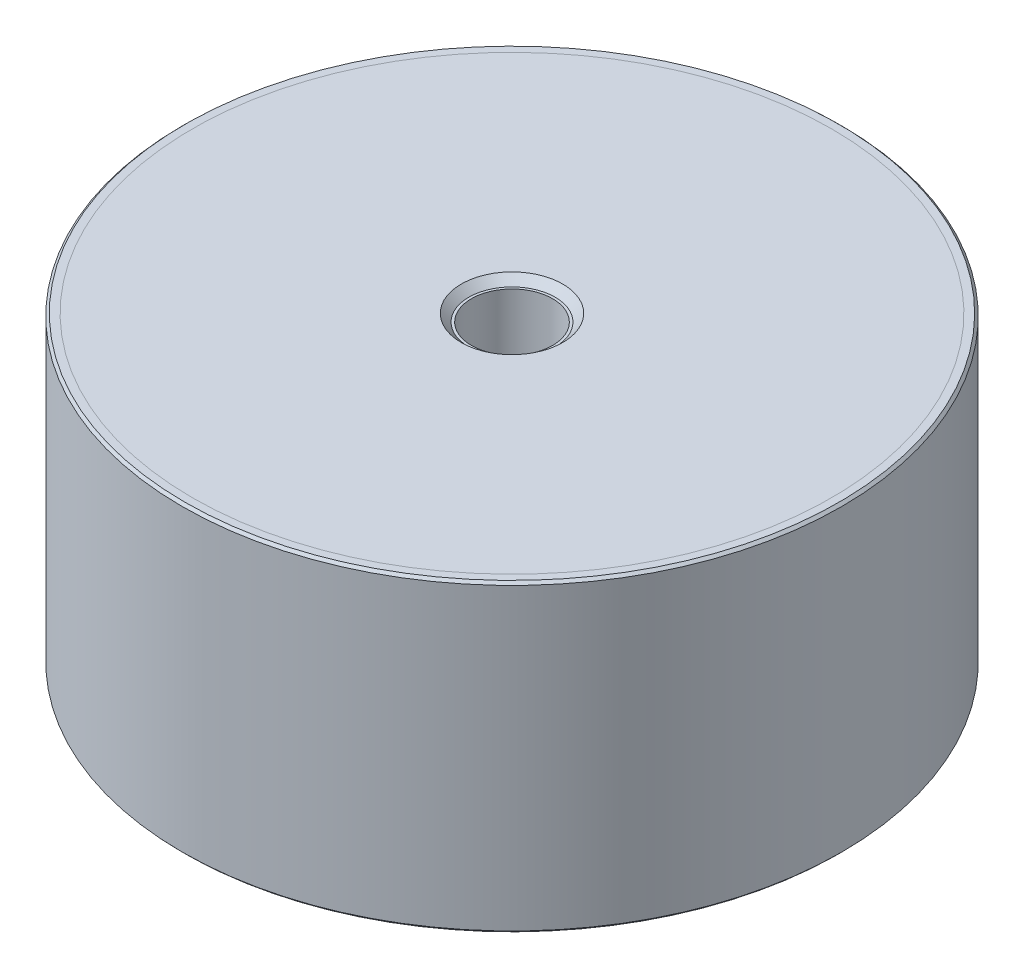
ISO-10303-21;
HEADER;
FILE_DESCRIPTION(('STEP AP214'),'2;1');
FILE_NAME('part.step','',(''),(''),'','','');
FILE_SCHEMA(('AUTOMOTIVE_DESIGN { 1 0 10303 214 1 1 1 1 }'));
ENDSEC;
DATA;
#1=APPLICATION_CONTEXT('core data for automotive mechanical design processes');
#2=APPLICATION_PROTOCOL_DEFINITION('international standard','automotive_design',2000,#1);
#3=PRODUCT_CONTEXT('',#1,'mechanical');
#4=PRODUCT('Part','Part','',(#3));
#5=PRODUCT_RELATED_PRODUCT_CATEGORY('part','',(#4));
#6=PRODUCT_DEFINITION_FORMATION('','',#4);
#7=PRODUCT_DEFINITION_CONTEXT('part definition',#1,'design');
#8=PRODUCT_DEFINITION('design','',#6,#7);
#9=PRODUCT_DEFINITION_SHAPE('','',#8);
#10=(LENGTH_UNIT() NAMED_UNIT(*) SI_UNIT(.MILLI.,.METRE.));
#11=(NAMED_UNIT(*) PLANE_ANGLE_UNIT() SI_UNIT($,.RADIAN.));
#12=(NAMED_UNIT(*) SI_UNIT($,.STERADIAN.) SOLID_ANGLE_UNIT());
#13=UNCERTAINTY_MEASURE_WITH_UNIT(LENGTH_MEASURE(1.E-05),#10,'distance_accuracy_value','');
#14=(GEOMETRIC_REPRESENTATION_CONTEXT(3) GLOBAL_UNCERTAINTY_ASSIGNED_CONTEXT((#13)) GLOBAL_UNIT_ASSIGNED_CONTEXT((#10,
#11,#12)) REPRESENTATION_CONTEXT('',''));
#15=CARTESIAN_POINT('',(0.,0.,0.));
#16=DIRECTION('',(0.,0.,1.));
#17=DIRECTION('',(1.,0.,0.));
#18=AXIS2_PLACEMENT_3D('',#15,#16,#17);
#19=CARTESIAN_POINT('',(0.,-57.,8.));
#20=DIRECTION('',(0.,1.,0.));
#21=DIRECTION('',(0.,0.,1.));
#22=AXIS2_PLACEMENT_3D('',#19,#20,#21);
#23=PLANE('',#22);
#24=CARTESIAN_POINT('',(0.,-57.,0.));
#25=DIRECTION('',(0.,1.,0.));
#26=DIRECTION('',(0.,0.,1.));
#27=AXIS2_PLACEMENT_3D('',#24,#25,#26);
#28=CIRCLE('',#27,8.50000000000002);
#29=CARTESIAN_POINT('',(0.,-57.,8.50000000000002));
#30=VERTEX_POINT('',#29);
#31=EDGE_CURVE('P0_E10',#30,#30,#28,.F.);
#32=ORIENTED_EDGE('',*,*,#31,.T.);
#33=EDGE_LOOP('',(#32));
#34=FACE_BOUND('',#33,.T.);
#35=CARTESIAN_POINT('',(0.,-57.,0.));
#36=DIRECTION('',(0.,1.,0.));
#37=DIRECTION('',(0.,0.,1.));
#38=AXIS2_PLACEMENT_3D('',#35,#36,#37);
#39=CIRCLE('',#38,63.);
#40=CARTESIAN_POINT('',(0.,-57.,63.));
#41=VERTEX_POINT('',#40);
#42=EDGE_CURVE('P0_E25',#41,#41,#39,.T.);
#43=ORIENTED_EDGE('',*,*,#42,.T.);
#44=EDGE_LOOP('',(#43));
#45=FACE_BOUND('',#44,.T.);
#46=ADVANCED_FACE('P0_F14',(#34,#45),#23,.T.);
#47=CARTESIAN_POINT('',(0.,11.0340428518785,0.));
#48=DIRECTION('',(0.,1.,0.));
#49=DIRECTION('',(0.,0.,1.));
#50=AXIS2_PLACEMENT_3D('',#47,#48,#49);
#51=CYLINDRICAL_SURFACE('',#50,63.);
#52=CARTESIAN_POINT('',(0.,-58.5,0.));
#53=DIRECTION('',(0.,1.,0.));
#54=DIRECTION('',(0.,0.,1.));
#55=AXIS2_PLACEMENT_3D('',#52,#53,#54);
#56=CIRCLE('',#55,63.);
#57=CARTESIAN_POINT('',(0.,-58.5,63.));
#58=VERTEX_POINT('',#57);
#59=EDGE_CURVE('P0_E29',#58,#58,#56,.T.);
#60=ORIENTED_EDGE('',*,*,#59,.T.);
#61=EDGE_LOOP('',(#60));
#62=FACE_BOUND('',#61,.T.);
#63=ORIENTED_EDGE('',*,*,#42,.F.);
#64=EDGE_LOOP('',(#63));
#65=FACE_BOUND('',#64,.T.);
#66=ADVANCED_FACE('P0_F35',(#62,#65),#51,.T.);
#67=CARTESIAN_POINT('',(0.,-58.5,63.));
#68=DIRECTION('',(0.,-1.,0.));
#69=DIRECTION('',(0.,0.,-1.));
#70=AXIS2_PLACEMENT_3D('',#67,#68,#69);
#71=PLANE('',#70);
#72=CARTESIAN_POINT('',(0.,-58.5,0.));
#73=DIRECTION('',(0.,-1.,0.));
#74=DIRECTION('',(0.,0.,-1.));
#75=AXIS2_PLACEMENT_3D('',#72,#73,#74);
#76=CIRCLE('',#75,10.);
#77=CARTESIAN_POINT('',(0.,-58.5,-10.));
#78=VERTEX_POINT('',#77);
#79=EDGE_CURVE('P0_E21',#78,#78,#76,.F.);
#80=ORIENTED_EDGE('',*,*,#79,.T.);
#81=EDGE_LOOP('',(#80));
#82=FACE_BOUND('',#81,.T.);
#83=ORIENTED_EDGE('',*,*,#59,.F.);
#84=EDGE_LOOP('',(#83));
#85=FACE_BOUND('',#84,.T.);
#86=ADVANCED_FACE('P0_F38',(#82,#85),#71,.T.);
#87=CARTESIAN_POINT('',(0.,-58.5,0.));
#88=DIRECTION('',(0.,-1.,0.));
#89=DIRECTION('',(0.,0.,-1.));
#90=AXIS2_PLACEMENT_3D('',#87,#88,#89);
#91=CONICAL_SURFACE('',#90,10.,0.785398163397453);
#92=ORIENTED_EDGE('',*,*,#31,.F.);
#93=EDGE_LOOP('',(#92));
#94=FACE_BOUND('',#93,.T.);
#95=ORIENTED_EDGE('',*,*,#79,.F.);
#96=EDGE_LOOP('',(#95));
#97=FACE_BOUND('',#96,.T.);
#98=ADVANCED_FACE('P0_F16',(#94,#97),#91,.F.);
#99=CLOSED_SHELL('',(#46,#66,#86,#98));
#100=MANIFOLD_SOLID_BREP('P0_B1',#99);
#101=CARTESIAN_POINT('',(0.,1.5,8.));
#102=DIRECTION('',(0.,1.,0.));
#103=DIRECTION('',(0.,0.,1.));
#104=AXIS2_PLACEMENT_3D('',#101,#102,#103);
#105=PLANE('',#104);
#106=CARTESIAN_POINT('',(0.,1.5,0.));
#107=DIRECTION('',(0.,1.,0.));
#108=DIRECTION('',(0.,0.,1.));
#109=AXIS2_PLACEMENT_3D('',#106,#107,#108);
#110=CIRCLE('',#109,10.);
#111=CARTESIAN_POINT('',(0.,1.5,10.));
#112=VERTEX_POINT('',#111);
#113=EDGE_CURVE('P1_E10',#112,#112,#110,.F.);
#114=ORIENTED_EDGE('',*,*,#113,.T.);
#115=EDGE_LOOP('',(#114));
#116=FACE_BOUND('',#115,.T.);
#117=CARTESIAN_POINT('',(0.,1.49999999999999,0.));
#118=DIRECTION('',(0.,1.,0.));
#119=DIRECTION('',(0.,0.,1.));
#120=AXIS2_PLACEMENT_3D('',#117,#118,#119);
#121=CIRCLE('',#120,63.);
#122=CARTESIAN_POINT('',(0.,1.49999999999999,63.));
#123=VERTEX_POINT('',#122);
#124=EDGE_CURVE('P1_E25',#123,#123,#121,.T.);
#125=ORIENTED_EDGE('',*,*,#124,.T.);
#126=EDGE_LOOP('',(#125));
#127=FACE_BOUND('',#126,.T.);
#128=ADVANCED_FACE('P1_F14',(#116,#127),#105,.T.);
#129=CARTESIAN_POINT('',(0.,69.5340428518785,0.));
#130=DIRECTION('',(0.,1.,0.));
#131=DIRECTION('',(0.,0.,1.));
#132=AXIS2_PLACEMENT_3D('',#129,#130,#131);
#133=CYLINDRICAL_SURFACE('',#132,63.);
#134=CARTESIAN_POINT('',(0.,0.,0.));
#135=DIRECTION('',(0.,1.,0.));
#136=DIRECTION('',(0.,0.,1.));
#137=AXIS2_PLACEMENT_3D('',#134,#135,#136);
#138=CIRCLE('',#137,63.);
#139=CARTESIAN_POINT('',(0.,0.,63.));
#140=VERTEX_POINT('',#139);
#141=EDGE_CURVE('P1_E29',#140,#140,#138,.T.);
#142=ORIENTED_EDGE('',*,*,#141,.T.);
#143=EDGE_LOOP('',(#142));
#144=FACE_BOUND('',#143,.T.);
#145=ORIENTED_EDGE('',*,*,#124,.F.);
#146=EDGE_LOOP('',(#145));
#147=FACE_BOUND('',#146,.T.);
#148=ADVANCED_FACE('P1_F35',(#144,#147),#133,.T.);
#149=CARTESIAN_POINT('',(0.,0.,63.));
#150=DIRECTION('',(0.,-1.,0.));
#151=DIRECTION('',(0.,0.,-1.));
#152=AXIS2_PLACEMENT_3D('',#149,#150,#151);
#153=PLANE('',#152);
#154=CARTESIAN_POINT('',(0.,0.,0.));
#155=DIRECTION('',(0.,-1.,0.));
#156=DIRECTION('',(0.,0.,-1.));
#157=AXIS2_PLACEMENT_3D('',#154,#155,#156);
#158=CIRCLE('',#157,8.50000000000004);
#159=CARTESIAN_POINT('',(0.,0.,-8.50000000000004));
#160=VERTEX_POINT('',#159);
#161=EDGE_CURVE('P1_E21',#160,#160,#158,.F.);
#162=ORIENTED_EDGE('',*,*,#161,.T.);
#163=EDGE_LOOP('',(#162));
#164=FACE_BOUND('',#163,.T.);
#165=ORIENTED_EDGE('',*,*,#141,.F.);
#166=EDGE_LOOP('',(#165));
#167=FACE_BOUND('',#166,.T.);
#168=ADVANCED_FACE('P1_F38',(#164,#167),#153,.T.);
#169=CARTESIAN_POINT('',(0.,-0.500000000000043,0.));
#170=DIRECTION('',(0.,1.,0.));
#171=DIRECTION('',(0.,0.,1.));
#172=AXIS2_PLACEMENT_3D('',#169,#170,#171);
#173=CONICAL_SURFACE('',#172,8.,0.785398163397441);
#174=ORIENTED_EDGE('',*,*,#113,.F.);
#175=EDGE_LOOP('',(#174));
#176=FACE_BOUND('',#175,.T.);
#177=ORIENTED_EDGE('',*,*,#161,.F.);
#178=EDGE_LOOP('',(#177));
#179=FACE_BOUND('',#178,.T.);
#180=ADVANCED_FACE('P1_F16',(#176,#179),#173,.F.);
#181=CLOSED_SHELL('',(#128,#148,#168,#180));
#182=MANIFOLD_SOLID_BREP('P1_B1',#181);
#183=CARTESIAN_POINT('',(0.,0.,0.));
#184=DIRECTION('',(0.,1.,0.));
#185=DIRECTION('',(0.,0.,1.));
#186=AXIS2_PLACEMENT_3D('',#183,#184,#185);
#187=PLANE('',#186);
#188=CARTESIAN_POINT('',(0.,0.,0.));
#189=DIRECTION('',(0.,1.,0.));
#190=DIRECTION('',(0.,0.,1.));
#191=AXIS2_PLACEMENT_3D('',#188,#189,#190);
#192=CIRCLE('',#191,8.);
#193=CARTESIAN_POINT('',(0.,0.,8.));
#194=VERTEX_POINT('',#193);
#195=EDGE_CURVE('P2_E46',#194,#194,#192,.T.);
#196=ORIENTED_EDGE('',*,*,#195,.F.);
#197=EDGE_LOOP('',(#196));
#198=FACE_BOUND('',#197,.T.);
#199=CARTESIAN_POINT('',(0.,0.,0.));
#200=DIRECTION('',(0.,1.,0.));
#201=DIRECTION('',(0.,0.,1.));
#202=AXIS2_PLACEMENT_3D('',#199,#200,#201);
#203=CIRCLE('',#202,63.);
#204=CARTESIAN_POINT('',(0.,0.,63.));
#205=VERTEX_POINT('',#204);
#206=EDGE_CURVE('P2_E33',#205,#205,#203,.T.);
#207=ORIENTED_EDGE('',*,*,#206,.T.);
#208=EDGE_LOOP('',(#207));
#209=FACE_BOUND('',#208,.T.);
#210=ADVANCED_FACE('P2_F13',(#198,#209),#187,.T.);
#211=CARTESIAN_POINT('',(0.,65.5134936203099,0.));
#212=DIRECTION('',(0.,1.,0.));
#213=DIRECTION('',(0.,0.,1.));
#214=AXIS2_PLACEMENT_3D('',#211,#212,#213);
#215=CYLINDRICAL_SURFACE('',#214,63.);
#216=CARTESIAN_POINT('',(0.,1.49999999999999,0.));
#217=DIRECTION('',(0.,1.,0.));
#218=DIRECTION('',(0.,0.,1.));
#219=AXIS2_PLACEMENT_3D('',#216,#217,#218);
#220=CIRCLE('',#219,63.);
#221=CARTESIAN_POINT('',(0.,1.49999999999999,63.));
#222=VERTEX_POINT('',#221);
#223=EDGE_CURVE('P2_E36',#222,#222,#220,.T.);
#224=ORIENTED_EDGE('',*,*,#223,.T.);
#225=EDGE_LOOP('',(#224));
#226=FACE_BOUND('',#225,.T.);
#227=ORIENTED_EDGE('',*,*,#206,.F.);
#228=EDGE_LOOP('',(#227));
#229=FACE_BOUND('',#228,.T.);
#230=ADVANCED_FACE('P2_F92',(#226,#229),#215,.F.);
#231=CARTESIAN_POINT('',(0.,1.49999999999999,63.));
#232=DIRECTION('',(0.,1.,0.));
#233=DIRECTION('',(0.,0.,1.));
#234=AXIS2_PLACEMENT_3D('',#231,#232,#233);
#235=PLANE('',#234);
#236=CARTESIAN_POINT('',(0.,1.49999999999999,0.));
#237=DIRECTION('',(0.,1.,0.));
#238=DIRECTION('',(0.,0.,1.));
#239=AXIS2_PLACEMENT_3D('',#236,#237,#238);
#240=CIRCLE('',#239,64.5);
#241=CARTESIAN_POINT('',(0.,1.49999999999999,64.5));
#242=VERTEX_POINT('',#241);
#243=EDGE_CURVE('P2_E9',#242,#242,#240,.T.);
#244=ORIENTED_EDGE('',*,*,#243,.T.);
#245=EDGE_LOOP('',(#244));
#246=FACE_BOUND('',#245,.T.);
#247=ORIENTED_EDGE('',*,*,#223,.F.);
#248=EDGE_LOOP('',(#247));
#249=FACE_BOUND('',#248,.T.);
#250=ADVANCED_FACE('P2_F88',(#246,#249),#235,.T.);
#251=CARTESIAN_POINT('',(0.,65.5134936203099,0.));
#252=DIRECTION('',(0.,1.,0.));
#253=DIRECTION('',(0.,0.,1.));
#254=AXIS2_PLACEMENT_3D('',#251,#252,#253);
#255=CYLINDRICAL_SURFACE('',#254,65.);
#256=CARTESIAN_POINT('',(0.,-58.,0.));
#257=DIRECTION('',(0.,-1.,0.));
#258=DIRECTION('',(0.,0.,-1.));
#259=AXIS2_PLACEMENT_3D('',#256,#257,#258);
#260=CIRCLE('',#259,65.);
#261=CARTESIAN_POINT('',(0.,-58.,-65.));
#262=VERTEX_POINT('',#261);
#263=EDGE_CURVE('P2_E24',#262,#262,#260,.F.);
#264=ORIENTED_EDGE('',*,*,#263,.T.);
#265=EDGE_LOOP('',(#264));
#266=FACE_BOUND('',#265,.T.);
#267=CARTESIAN_POINT('',(0.,0.999999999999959,0.));
#268=DIRECTION('',(0.,1.,0.));
#269=DIRECTION('',(0.,0.,1.));
#270=AXIS2_PLACEMENT_3D('',#267,#268,#269);
#271=CIRCLE('',#270,65.);
#272=CARTESIAN_POINT('',(0.,0.999999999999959,65.));
#273=VERTEX_POINT('',#272);
#274=EDGE_CURVE('P2_E28',#273,#273,#271,.F.);
#275=ORIENTED_EDGE('',*,*,#274,.T.);
#276=EDGE_LOOP('',(#275));
#277=FACE_BOUND('',#276,.T.);
#278=ADVANCED_FACE('P2_F82',(#266,#277),#255,.T.);
#279=CARTESIAN_POINT('',(0.,-58.5,65.));
#280=DIRECTION('',(0.,-1.,0.));
#281=DIRECTION('',(0.,0.,-1.));
#282=AXIS2_PLACEMENT_3D('',#279,#280,#281);
#283=PLANE('',#282);
#284=CARTESIAN_POINT('',(0.,-58.5,0.));
#285=DIRECTION('',(0.,-1.,0.));
#286=DIRECTION('',(0.,0.,-1.));
#287=AXIS2_PLACEMENT_3D('',#284,#285,#286);
#288=CIRCLE('',#287,64.5);
#289=CARTESIAN_POINT('',(0.,-58.5,-64.5));
#290=VERTEX_POINT('',#289);
#291=EDGE_CURVE('P2_E20',#290,#290,#288,.T.);
#292=ORIENTED_EDGE('',*,*,#291,.T.);
#293=EDGE_LOOP('',(#292));
#294=FACE_BOUND('',#293,.T.);
#295=CARTESIAN_POINT('',(0.,-58.5,0.));
#296=DIRECTION('',(0.,1.,0.));
#297=DIRECTION('',(0.,0.,1.));
#298=AXIS2_PLACEMENT_3D('',#295,#296,#297);
#299=CIRCLE('',#298,63.);
#300=CARTESIAN_POINT('',(0.,-58.5,63.));
#301=VERTEX_POINT('',#300);
#302=EDGE_CURVE('P2_E39',#301,#301,#299,.T.);
#303=ORIENTED_EDGE('',*,*,#302,.T.);
#304=EDGE_LOOP('',(#303));
#305=FACE_BOUND('',#304,.T.);
#306=ADVANCED_FACE('P2_F77',(#294,#305),#283,.T.);
#307=CARTESIAN_POINT('',(0.,65.5134936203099,0.));
#308=DIRECTION('',(0.,1.,0.));
#309=DIRECTION('',(0.,0.,1.));
#310=AXIS2_PLACEMENT_3D('',#307,#308,#309);
#311=CYLINDRICAL_SURFACE('',#310,63.);
#312=CARTESIAN_POINT('',(0.,-57.,0.));
#313=DIRECTION('',(0.,1.,0.));
#314=DIRECTION('',(0.,0.,1.));
#315=AXIS2_PLACEMENT_3D('',#312,#313,#314);
#316=CIRCLE('',#315,63.);
#317=CARTESIAN_POINT('',(0.,-57.,63.));
#318=VERTEX_POINT('',#317);
#319=EDGE_CURVE('P2_E42',#318,#318,#316,.T.);
#320=ORIENTED_EDGE('',*,*,#319,.T.);
#321=EDGE_LOOP('',(#320));
#322=FACE_BOUND('',#321,.T.);
#323=ORIENTED_EDGE('',*,*,#302,.F.);
#324=EDGE_LOOP('',(#323));
#325=FACE_BOUND('',#324,.T.);
#326=ADVANCED_FACE('P2_F71',(#322,#325),#311,.F.);
#327=CARTESIAN_POINT('',(0.,-57.,63.));
#328=DIRECTION('',(0.,-1.,0.));
#329=DIRECTION('',(0.,0.,-1.));
#330=AXIS2_PLACEMENT_3D('',#327,#328,#329);
#331=PLANE('',#330);
#332=CARTESIAN_POINT('',(0.,-57.,0.));
#333=DIRECTION('',(0.,-1.,0.));
#334=DIRECTION('',(0.,0.,-1.));
#335=AXIS2_PLACEMENT_3D('',#332,#333,#334);
#336=CIRCLE('',#335,8.);
#337=CARTESIAN_POINT('',(0.,-57.,-8.));
#338=VERTEX_POINT('',#337);
#339=EDGE_CURVE('P2_E52',#338,#338,#336,.T.);
#340=ORIENTED_EDGE('',*,*,#339,.F.);
#341=EDGE_LOOP('',(#340));
#342=FACE_BOUND('',#341,.T.);
#343=ORIENTED_EDGE('',*,*,#319,.F.);
#344=EDGE_LOOP('',(#343));
#345=FACE_BOUND('',#344,.T.);
#346=ADVANCED_FACE('P2_F67',(#342,#345),#331,.T.);
#347=CARTESIAN_POINT('',(0.,-58.,0.));
#348=DIRECTION('',(0.,1.,0.));
#349=DIRECTION('',(0.,0.,1.));
#350=AXIS2_PLACEMENT_3D('',#347,#348,#349);
#351=CONICAL_SURFACE('',#350,65.,0.785398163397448);
#352=ORIENTED_EDGE('',*,*,#291,.F.);
#353=EDGE_LOOP('',(#352));
#354=FACE_BOUND('',#353,.T.);
#355=ORIENTED_EDGE('',*,*,#263,.F.);
#356=EDGE_LOOP('',(#355));
#357=FACE_BOUND('',#356,.T.);
#358=ADVANCED_FACE('P2_F70',(#354,#357),#351,.T.);
#359=CARTESIAN_POINT('',(0.,1.49999999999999,0.));
#360=DIRECTION('',(0.,-1.,0.));
#361=DIRECTION('',(0.,0.,-1.));
#362=AXIS2_PLACEMENT_3D('',#359,#360,#361);
#363=CONICAL_SURFACE('',#362,64.5,0.785398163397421);
#364=ORIENTED_EDGE('',*,*,#274,.F.);
#365=EDGE_LOOP('',(#364));
#366=FACE_BOUND('',#365,.T.);
#367=ORIENTED_EDGE('',*,*,#243,.F.);
#368=EDGE_LOOP('',(#367));
#369=FACE_BOUND('',#368,.T.);
#370=ADVANCED_FACE('P2_F15',(#366,#369),#363,.T.);
#371=CARTESIAN_POINT('',(0.,-14.5,0.));
#372=DIRECTION('',(0.,1.,0.));
#373=DIRECTION('',(0.,0.,1.));
#374=AXIS2_PLACEMENT_3D('',#371,#372,#373);
#375=CYLINDRICAL_SURFACE('',#374,8.);
#376=CARTESIAN_POINT('',(0.,-14.5,0.));
#377=DIRECTION('',(0.,1.,0.));
#378=DIRECTION('',(0.,0.,1.));
#379=AXIS2_PLACEMENT_3D('',#376,#377,#378);
#380=CIRCLE('',#379,8.);
#381=CARTESIAN_POINT('',(0.,-14.5,8.));
#382=VERTEX_POINT('',#381);
#383=EDGE_CURVE('P2_E45',#382,#382,#380,.T.);
#384=CARTESIAN_POINT('',(0.,-14.5,8.));
#385=CARTESIAN_POINT('',(0.,-14.3489583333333,8.));
#386=CARTESIAN_POINT('',(0.,-14.1979166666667,8.));
#387=CARTESIAN_POINT('',(0.,-13.8958333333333,8.));
#388=CARTESIAN_POINT('',(0.,-13.7447916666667,8.));
#389=CARTESIAN_POINT('',(0.,-13.4427083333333,8.));
#390=CARTESIAN_POINT('',(0.,-13.2916666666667,8.));
#391=CARTESIAN_POINT('',(0.,-12.9895833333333,8.));
#392=CARTESIAN_POINT('',(0.,-12.8385416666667,8.));
#393=CARTESIAN_POINT('',(0.,-12.5364583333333,8.));
#394=CARTESIAN_POINT('',(0.,-12.3854166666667,8.));
#395=CARTESIAN_POINT('',(0.,-12.0833333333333,8.));
#396=CARTESIAN_POINT('',(0.,-11.9322916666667,8.));
#397=CARTESIAN_POINT('',(0.,-11.6302083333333,8.));
#398=CARTESIAN_POINT('',(0.,-11.4791666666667,8.));
#399=CARTESIAN_POINT('',(0.,-11.1770833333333,8.));
#400=CARTESIAN_POINT('',(0.,-11.0260416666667,8.));
#401=CARTESIAN_POINT('',(0.,-10.7239583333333,8.));
#402=CARTESIAN_POINT('',(0.,-10.5729166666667,8.));
#403=CARTESIAN_POINT('',(0.,-10.2708333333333,8.));
#404=CARTESIAN_POINT('',(0.,-10.1197916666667,8.));
#405=CARTESIAN_POINT('',(0.,-9.81770833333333,8.));
#406=CARTESIAN_POINT('',(0.,-9.66666666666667,8.));
#407=CARTESIAN_POINT('',(0.,-9.36458333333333,8.));
#408=CARTESIAN_POINT('',(0.,-9.21354166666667,8.));
#409=CARTESIAN_POINT('',(0.,-8.91145833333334,8.));
#410=CARTESIAN_POINT('',(0.,-8.76041666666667,8.));
#411=CARTESIAN_POINT('',(0.,-8.45833333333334,8.));
#412=CARTESIAN_POINT('',(0.,-8.30729166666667,8.));
#413=CARTESIAN_POINT('',(0.,-8.00520833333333,8.));
#414=CARTESIAN_POINT('',(0.,-7.85416666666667,8.));
#415=CARTESIAN_POINT('',(0.,-7.55208333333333,8.));
#416=CARTESIAN_POINT('',(0.,-7.40104166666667,8.));
#417=CARTESIAN_POINT('',(0.,-7.09895833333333,8.));
#418=CARTESIAN_POINT('',(0.,-6.94791666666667,8.));
#419=CARTESIAN_POINT('',(0.,-6.64583333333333,8.));
#420=CARTESIAN_POINT('',(0.,-6.49479166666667,8.));
#421=CARTESIAN_POINT('',(0.,-6.19270833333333,8.));
#422=CARTESIAN_POINT('',(0.,-6.04166666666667,8.));
#423=CARTESIAN_POINT('',(0.,-5.73958333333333,8.));
#424=CARTESIAN_POINT('',(0.,-5.58854166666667,8.));
#425=CARTESIAN_POINT('',(0.,-5.28645833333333,8.));
#426=CARTESIAN_POINT('',(0.,-5.13541666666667,8.));
#427=CARTESIAN_POINT('',(0.,-4.83333333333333,8.));
#428=CARTESIAN_POINT('',(0.,-4.68229166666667,8.));
#429=CARTESIAN_POINT('',(0.,-4.38020833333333,8.));
#430=CARTESIAN_POINT('',(0.,-4.22916666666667,8.));
#431=CARTESIAN_POINT('',(0.,-3.92708333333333,8.));
#432=CARTESIAN_POINT('',(0.,-3.77604166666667,8.));
#433=CARTESIAN_POINT('',(0.,-3.47395833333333,8.));
#434=CARTESIAN_POINT('',(0.,-3.32291666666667,8.));
#435=CARTESIAN_POINT('',(0.,-3.02083333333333,8.));
#436=CARTESIAN_POINT('',(0.,-2.86979166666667,8.));
#437=CARTESIAN_POINT('',(0.,-2.56770833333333,8.));
#438=CARTESIAN_POINT('',(0.,-2.41666666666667,8.));
#439=CARTESIAN_POINT('',(0.,-2.11458333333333,8.));
#440=CARTESIAN_POINT('',(0.,-1.96354166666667,8.));
#441=CARTESIAN_POINT('',(0.,-1.66145833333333,8.));
#442=CARTESIAN_POINT('',(0.,-1.51041666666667,8.));
#443=CARTESIAN_POINT('',(0.,-1.20833333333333,8.));
#444=CARTESIAN_POINT('',(0.,-1.05729166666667,8.));
#445=CARTESIAN_POINT('',(0.,-0.755208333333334,8.));
#446=CARTESIAN_POINT('',(0.,-0.604166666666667,8.));
#447=CARTESIAN_POINT('',(0.,-0.302083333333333,8.));
#448=CARTESIAN_POINT('',(0.,-0.151041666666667,8.));
#449=CARTESIAN_POINT('',(0.,0.,8.));
#450=B_SPLINE_CURVE_WITH_KNOTS('',3,(#384,#385,#386,#387,#388,#389,#390,#391,#392,#393,#394,
#395,#396,#397,#398,#399,#400,#401,#402,#403,#404,#405,#406,#407,#408,#409,#410,#411,#412,#413,
#414,#415,#416,#417,#418,#419,#420,#421,#422,#423,#424,#425,#426,#427,#428,#429,#430,#431,#432,
#433,#434,#435,#436,#437,#438,#439,#440,#441,#442,#443,#444,#445,#446,#447,#448,#449),
.UNSPECIFIED.,.F.,.F.,(4,2,2,2,2,2,2,2,2,2,2,2,2,2,2,2,2,2,2,2,2,2,2,2,2,2,2,2,2,2,2,2,4),(0.,
0.453124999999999,0.906249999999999,1.359375,1.8125,2.265625,2.71875,3.171875,3.625,4.078125,
4.53125,4.984375,5.4375,5.890625,6.34375,6.796875,7.25,7.703125,8.15625,8.609375,9.0625,
9.515625,9.96875,10.421875,10.875,11.328125,11.78125,12.234375,12.6875,13.140625,13.59375,
14.046875,14.5),.UNSPECIFIED.);
#451=EDGE_CURVE('P2_BSEAM108',#382,#194,#450,.T.);
#452=ORIENTED_EDGE('',*,*,#383,.F.);
#453=ORIENTED_EDGE('',*,*,#195,.T.);
#454=ORIENTED_EDGE('',*,*,#451,.T.);
#455=ORIENTED_EDGE('',*,*,#451,.F.);
#456=EDGE_LOOP('',(#452,#454,#453,#455));
#457=FACE_BOUND('',#456,.T.);
#458=ADVANCED_FACE('P2_F108',(#457),#375,.F.);
#459=CARTESIAN_POINT('',(0.,-14.5,0.));
#460=DIRECTION('',(0.,1.,0.));
#461=DIRECTION('',(0.,0.,1.));
#462=AXIS2_PLACEMENT_3D('',#459,#460,#461);
#463=PLANE('',#462);
#464=ORIENTED_EDGE('',*,*,#383,.T.);
#465=EDGE_LOOP('',(#464));
#466=FACE_BOUND('',#465,.T.);
#467=ADVANCED_FACE('P2_F63',(#466),#463,.T.);
#468=CARTESIAN_POINT('',(0.,-42.5,0.));
#469=DIRECTION('',(0.,-1.,0.));
#470=DIRECTION('',(0.,0.,-1.));
#471=AXIS2_PLACEMENT_3D('',#468,#469,#470);
#472=CYLINDRICAL_SURFACE('',#471,8.);
#473=CARTESIAN_POINT('',(0.,-42.5,0.));
#474=DIRECTION('',(0.,-1.,0.));
#475=DIRECTION('',(0.,0.,-1.));
#476=AXIS2_PLACEMENT_3D('',#473,#474,#475);
#477=CIRCLE('',#476,8.);
#478=CARTESIAN_POINT('',(0.,-42.5,-8.));
#479=VERTEX_POINT('',#478);
#480=EDGE_CURVE('P2_E49',#479,#479,#477,.T.);
#481=CARTESIAN_POINT('',(0.,-42.5,-8.));
#482=CARTESIAN_POINT('',(0.,-42.6510416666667,-8.));
#483=CARTESIAN_POINT('',(0.,-42.8020833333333,-8.));
#484=CARTESIAN_POINT('',(0.,-43.1041666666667,-8.));
#485=CARTESIAN_POINT('',(0.,-43.2552083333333,-8.));
#486=CARTESIAN_POINT('',(0.,-43.5572916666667,-8.));
#487=CARTESIAN_POINT('',(0.,-43.7083333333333,-8.));
#488=CARTESIAN_POINT('',(0.,-44.0104166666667,-8.));
#489=CARTESIAN_POINT('',(0.,-44.1614583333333,-8.));
#490=CARTESIAN_POINT('',(0.,-44.4635416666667,-8.));
#491=CARTESIAN_POINT('',(0.,-44.6145833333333,-8.));
#492=CARTESIAN_POINT('',(0.,-44.9166666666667,-8.));
#493=CARTESIAN_POINT('',(0.,-45.0677083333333,-8.));
#494=CARTESIAN_POINT('',(0.,-45.3697916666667,-8.));
#495=CARTESIAN_POINT('',(0.,-45.5208333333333,-8.));
#496=CARTESIAN_POINT('',(0.,-45.8229166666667,-8.));
#497=CARTESIAN_POINT('',(0.,-45.9739583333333,-8.));
#498=CARTESIAN_POINT('',(0.,-46.2760416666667,-8.));
#499=CARTESIAN_POINT('',(0.,-46.4270833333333,-8.));
#500=CARTESIAN_POINT('',(0.,-46.7291666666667,-8.));
#501=CARTESIAN_POINT('',(0.,-46.8802083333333,-8.));
#502=CARTESIAN_POINT('',(0.,-47.1822916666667,-8.));
#503=CARTESIAN_POINT('',(0.,-47.3333333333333,-8.));
#504=CARTESIAN_POINT('',(0.,-47.6354166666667,-8.));
#505=CARTESIAN_POINT('',(0.,-47.7864583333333,-8.));
#506=CARTESIAN_POINT('',(0.,-48.0885416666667,-8.));
#507=CARTESIAN_POINT('',(0.,-48.2395833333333,-8.));
#508=CARTESIAN_POINT('',(0.,-48.5416666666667,-8.));
#509=CARTESIAN_POINT('',(0.,-48.6927083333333,-8.));
#510=CARTESIAN_POINT('',(0.,-48.9947916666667,-8.));
#511=CARTESIAN_POINT('',(0.,-49.1458333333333,-8.));
#512=CARTESIAN_POINT('',(0.,-49.4479166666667,-8.));
#513=CARTESIAN_POINT('',(0.,-49.5989583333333,-8.));
#514=CARTESIAN_POINT('',(0.,-49.9010416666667,-8.));
#515=CARTESIAN_POINT('',(0.,-50.0520833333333,-8.));
#516=CARTESIAN_POINT('',(0.,-50.3541666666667,-8.));
#517=CARTESIAN_POINT('',(0.,-50.5052083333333,-8.));
#518=CARTESIAN_POINT('',(0.,-50.8072916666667,-8.));
#519=CARTESIAN_POINT('',(0.,-50.9583333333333,-8.));
#520=CARTESIAN_POINT('',(0.,-51.2604166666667,-8.));
#521=CARTESIAN_POINT('',(0.,-51.4114583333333,-8.));
#522=CARTESIAN_POINT('',(0.,-51.7135416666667,-8.));
#523=CARTESIAN_POINT('',(0.,-51.8645833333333,-8.));
#524=CARTESIAN_POINT('',(0.,-52.1666666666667,-8.));
#525=CARTESIAN_POINT('',(0.,-52.3177083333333,-8.));
#526=CARTESIAN_POINT('',(0.,-52.6197916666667,-8.));
#527=CARTESIAN_POINT('',(0.,-52.7708333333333,-8.));
#528=CARTESIAN_POINT('',(0.,-53.0729166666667,-8.));
#529=CARTESIAN_POINT('',(0.,-53.2239583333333,-8.));
#530=CARTESIAN_POINT('',(0.,-53.5260416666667,-8.));
#531=CARTESIAN_POINT('',(0.,-53.6770833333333,-8.));
#532=CARTESIAN_POINT('',(0.,-53.9791666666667,-8.));
#533=CARTESIAN_POINT('',(0.,-54.1302083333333,-8.));
#534=CARTESIAN_POINT('',(0.,-54.4322916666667,-8.));
#535=CARTESIAN_POINT('',(0.,-54.5833333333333,-8.));
#536=CARTESIAN_POINT('',(0.,-54.8854166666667,-8.));
#537=CARTESIAN_POINT('',(0.,-55.0364583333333,-8.));
#538=CARTESIAN_POINT('',(0.,-55.3385416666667,-8.));
#539=CARTESIAN_POINT('',(0.,-55.4895833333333,-8.));
#540=CARTESIAN_POINT('',(0.,-55.7916666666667,-8.));
#541=CARTESIAN_POINT('',(0.,-55.9427083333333,-8.));
#542=CARTESIAN_POINT('',(0.,-56.2447916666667,-8.));
#543=CARTESIAN_POINT('',(0.,-56.3958333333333,-8.));
#544=CARTESIAN_POINT('',(0.,-56.6979166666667,-8.));
#545=CARTESIAN_POINT('',(0.,-56.8489583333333,-8.));
#546=CARTESIAN_POINT('',(0.,-57.,-8.));
#547=B_SPLINE_CURVE_WITH_KNOTS('',3,(#481,#482,#483,#484,#485,#486,#487,#488,#489,#490,#491,
#492,#493,#494,#495,#496,#497,#498,#499,#500,#501,#502,#503,#504,#505,#506,#507,#508,#509,#510,
#511,#512,#513,#514,#515,#516,#517,#518,#519,#520,#521,#522,#523,#524,#525,#526,#527,#528,#529,
#530,#531,#532,#533,#534,#535,#536,#537,#538,#539,#540,#541,#542,#543,#544,#545,#546),
.UNSPECIFIED.,.F.,.F.,(4,2,2,2,2,2,2,2,2,2,2,2,2,2,2,2,2,2,2,2,2,2,2,2,2,2,2,2,2,2,2,2,4),(0.,
0.453125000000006,0.906250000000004,1.359375,1.8125,2.265625,2.71875000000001,3.171875,3.625,
4.078125,4.53125,4.984375,5.4375,5.890625,6.34375,6.796875,7.25,7.70312500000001,8.15625,
8.609375,9.0625,9.515625,9.96875,10.421875,10.875,11.328125,11.78125,12.234375,12.6875,
13.140625,13.59375,14.046875,14.5),.UNSPECIFIED.);
#548=EDGE_CURVE('P2_BSEAM60',#479,#338,#547,.T.);
#549=ORIENTED_EDGE('',*,*,#480,.F.);
#550=ORIENTED_EDGE('',*,*,#339,.T.);
#551=ORIENTED_EDGE('',*,*,#548,.T.);
#552=ORIENTED_EDGE('',*,*,#548,.F.);
#553=EDGE_LOOP('',(#549,#551,#550,#552));
#554=FACE_BOUND('',#553,.T.);
#555=ADVANCED_FACE('P2_F60',(#554),#472,.F.);
#556=CARTESIAN_POINT('',(0.,-42.5,0.));
#557=DIRECTION('',(0.,-1.,0.));
#558=DIRECTION('',(0.,0.,-1.));
#559=AXIS2_PLACEMENT_3D('',#556,#557,#558);
#560=PLANE('',#559);
#561=ORIENTED_EDGE('',*,*,#480,.T.);
#562=EDGE_LOOP('',(#561));
#563=FACE_BOUND('',#562,.T.);
#564=ADVANCED_FACE('P2_F58',(#563),#560,.T.);
#565=CLOSED_SHELL('',(#210,#230,#250,#278,#306,#326,#346,#358,#370,#458,#467,#555,#564));
#566=MANIFOLD_SOLID_BREP('P2_B1',#565);
#567=ADVANCED_BREP_SHAPE_REPRESENTATION('',(#18,#100,#182,#566),#14);
#568=SHAPE_DEFINITION_REPRESENTATION(#9,#567);
ENDSEC;
END-ISO-10303-21;
